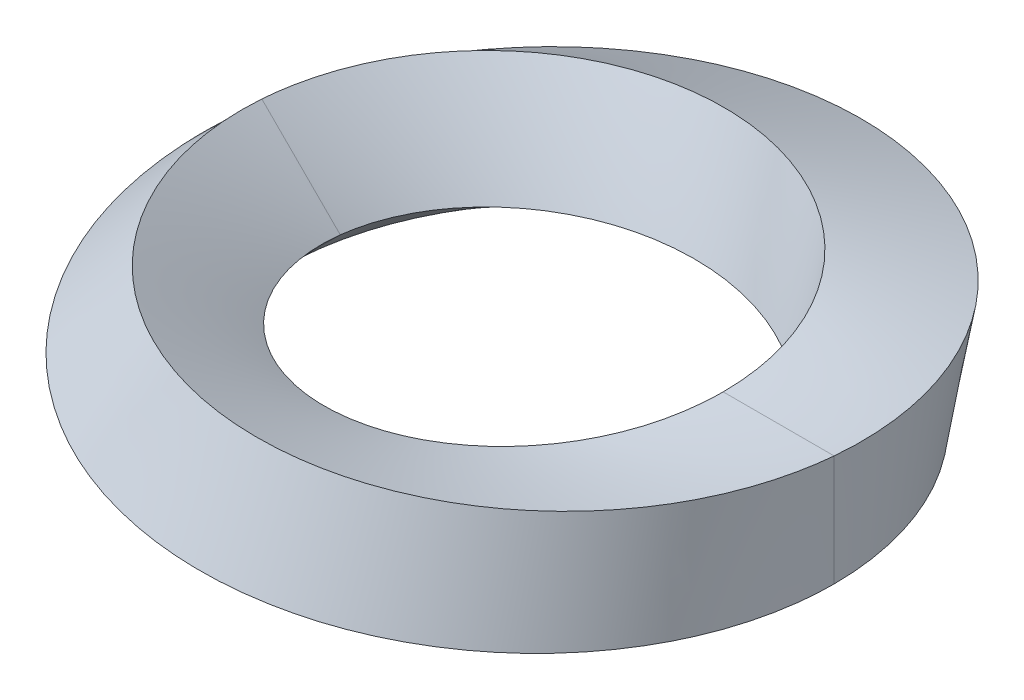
ISO-10303-21;
HEADER;
FILE_DESCRIPTION(('STEP AP214'),'2;1');
FILE_NAME('part.step','',(''),(''),'','','');
FILE_SCHEMA(('AUTOMOTIVE_DESIGN { 1 0 10303 214 1 1 1 1 }'));
ENDSEC;
DATA;
#1=APPLICATION_CONTEXT('core data for automotive mechanical design processes');
#2=APPLICATION_PROTOCOL_DEFINITION('international standard','automotive_design',2000,#1);
#3=PRODUCT_CONTEXT('',#1,'mechanical');
#4=PRODUCT('Part','Part','',(#3));
#5=PRODUCT_RELATED_PRODUCT_CATEGORY('part','',(#4));
#6=PRODUCT_DEFINITION_FORMATION('','',#4);
#7=PRODUCT_DEFINITION_CONTEXT('part definition',#1,'design');
#8=PRODUCT_DEFINITION('design','',#6,#7);
#9=PRODUCT_DEFINITION_SHAPE('','',#8);
#10=(LENGTH_UNIT() NAMED_UNIT(*) SI_UNIT(.MILLI.,.METRE.));
#11=(NAMED_UNIT(*) PLANE_ANGLE_UNIT() SI_UNIT($,.RADIAN.));
#12=(NAMED_UNIT(*) SI_UNIT($,.STERADIAN.) SOLID_ANGLE_UNIT());
#13=UNCERTAINTY_MEASURE_WITH_UNIT(LENGTH_MEASURE(1.E-05),#10,'distance_accuracy_value','');
#14=(GEOMETRIC_REPRESENTATION_CONTEXT(3) GLOBAL_UNCERTAINTY_ASSIGNED_CONTEXT((#13)) GLOBAL_UNIT_ASSIGNED_CONTEXT((#10,
#11,#12)) REPRESENTATION_CONTEXT('',''));
#15=CARTESIAN_POINT('',(0.,0.,0.));
#16=DIRECTION('',(0.,0.,1.));
#17=DIRECTION('',(1.,0.,0.));
#18=AXIS2_PLACEMENT_3D('',#15,#16,#17);
#19=CARTESIAN_POINT('',(67.9377377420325,18.5666751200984,0.));
#20=CARTESIAN_POINT('',(68.5452850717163,19.1742224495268,-8.89396355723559));
#21=CARTESIAN_POINT('',(67.4154024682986,19.7520111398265,-18.0281162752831));
#22=CARTESIAN_POINT('',(61.6450134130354,20.8422366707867,-35.4304583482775));
#23=CARTESIAN_POINT('',(57.0041810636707,21.3547175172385,-43.6909584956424));
#24=CARTESIAN_POINT('',(44.7013487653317,22.3094830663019,-58.01457133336));
#25=CARTESIAN_POINT('',(37.0416808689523,22.7517662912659,-64.0708977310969));
#26=CARTESIAN_POINT('',(19.6925415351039,23.5618769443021,-72.8976314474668));
#27=CARTESIAN_POINT('',(10.0080931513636,23.9297031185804,-75.6623421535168));
#28=CARTESIAN_POINT('',(-10.0080931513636,24.5873570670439,-77.2500592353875));
#29=CARTESIAN_POINT('',(-20.3326172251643,24.8771838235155,-76.0695659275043));
#30=CARTESIAN_POINT('',(-40.0413099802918,25.3760475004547,-69.685987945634));
#31=CARTESIAN_POINT('',(-49.4170484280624,25.5850836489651,-64.4824716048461));
#32=CARTESIAN_POINT('',(-65.674308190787,25.9203527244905,-50.6088850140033));
#33=CARTESIAN_POINT('',(-72.5475136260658,26.0465851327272,-41.9418764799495));
#34=CARTESIAN_POINT('',(-82.5362959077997,26.2150307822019,-22.2959407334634));
#35=CARTESIAN_POINT('',(-85.6448142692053,26.2572437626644,-11.3298225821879));
#36=CARTESIAN_POINT('',(-86.5044128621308,26.2572437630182,0.));
#37=CARTESIAN_POINT('',(67.9377377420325,6.18889170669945,0.));
#38=CARTESIAN_POINT('',(68.1402805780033,6.79652021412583,-8.89515193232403));
#39=CARTESIAN_POINT('',(66.6061712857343,7.39412711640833,-17.8648187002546));
#40=CARTESIAN_POINT('',(60.2124787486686,8.5637586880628,-34.6651861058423));
#41=CARTESIAN_POINT('',(55.3540755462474,9.13574606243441,-42.4878784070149));
#42=CARTESIAN_POINT('',(42.9364315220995,10.2485589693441,-55.802628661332));
#43=CARTESIAN_POINT('',(35.3804729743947,10.7893827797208,-61.2894269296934));
#44=CARTESIAN_POINT('',(18.6037243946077,11.8346600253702,-69.0399545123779));
#45=CARTESIAN_POINT('',(9.38805106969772,12.3391118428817,-71.2997980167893));
#46=CARTESIAN_POINT('',(-9.38805106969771,13.3067868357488,-72.1390580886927));
#47=CARTESIAN_POINT('',(-18.9420655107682,13.7700085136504,-70.7166247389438));
#48=CARTESIAN_POINT('',(-36.9660633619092,14.6507620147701,-64.2575382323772));
#49=CARTESIAN_POINT('',(-45.4291290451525,15.0682924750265,-59.2215315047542));
#50=CARTESIAN_POINT('',(-59.9370655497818,15.8536423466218,-46.1446630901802));
#51=CARTESIAN_POINT('',(-65.9754910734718,16.2214605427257,-38.1070922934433));
#52=CARTESIAN_POINT('',(-74.5990071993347,16.9038434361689,-20.1207714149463));
#53=CARTESIAN_POINT('',(-77.1789728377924,17.2183164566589,-10.1827684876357));
#54=CARTESIAN_POINT('',(-77.7519982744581,17.5048291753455,0.));
#55=CARTESIAN_POINT('',(67.9377377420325,-6.18889170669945,0.));
#56=CARTESIAN_POINT('',(67.7351669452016,-5.58117931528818,-8.89637992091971));
#57=CARTESIAN_POINT('',(65.7969401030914,-4.96375690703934,-17.7015211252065));
#58=CARTESIAN_POINT('',(58.7799440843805,-3.7147192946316,-33.8999138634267));
#59=CARTESIAN_POINT('',(53.7039700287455,-3.08322539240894,-41.2847983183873));
#60=CARTESIAN_POINT('',(41.171514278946,-1.81236512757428,-53.5906859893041));
#61=CARTESIAN_POINT('',(33.7192650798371,-1.17300073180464,-58.5079561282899));
#62=CARTESIAN_POINT('',(17.5149072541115,0.107443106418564,-65.182277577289));
#63=CARTESIAN_POINT('',(8.76800898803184,0.748520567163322,-66.9372538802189));
#64=CARTESIAN_POINT('',(-8.76800898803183,2.02621660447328,-67.0280569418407));
#65=CARTESIAN_POINT('',(-17.5515137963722,2.66283320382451,-65.3636835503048));
#66=CARTESIAN_POINT('',(-33.8908167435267,3.92547652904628,-58.829088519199));
#67=CARTESIAN_POINT('',(-41.4412096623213,4.55150130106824,-53.9605914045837));
#68=CARTESIAN_POINT('',(-54.199822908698,5.78693196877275,-41.6804411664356));
#69=CARTESIAN_POINT('',(-59.4034685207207,6.39633595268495,-34.2723081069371));
#70=CARTESIAN_POINT('',(-66.6617184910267,7.59265609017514,-17.9456020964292));
#71=CARTESIAN_POINT('',(-68.7130968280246,8.17944086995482,-9.03569537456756));
#72=CARTESIAN_POINT('',(-68.9995836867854,8.75241458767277,0.));
#73=CARTESIAN_POINT('',(67.9377377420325,-18.5666751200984,0.));
#74=CARTESIAN_POINT('',(67.3299397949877,-17.9588771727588,-8.89763238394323));
#75=CARTESIAN_POINT('',(64.9877089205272,-17.3216409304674,-17.5382235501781));
#76=CARTESIAN_POINT('',(57.3474094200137,-15.9931972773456,-33.1346416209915));
#77=CARTESIAN_POINT('',(52.0538645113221,-15.3021968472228,-40.0817182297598));
#78=CARTESIAN_POINT('',(39.4065970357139,-13.8732892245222,-51.3787433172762));
#79=CARTESIAN_POINT('',(32.0580571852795,-13.1353842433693,-55.7264853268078));
#80=CARTESIAN_POINT('',(16.4260901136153,-11.6197738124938,-61.3246006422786));
#81=CARTESIAN_POINT('',(8.14796690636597,-10.8420707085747,-62.5747097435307));
#82=CARTESIAN_POINT('',(-8.14796690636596,-9.25435362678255,-61.9170557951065));
#83=CARTESIAN_POINT('',(-16.1609620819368,-8.44434210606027,-60.0107423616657));
#84=CARTESIAN_POINT('',(-30.8155701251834,-6.79980895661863,-53.4006388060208));
#85=CARTESIAN_POINT('',(-37.4532902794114,-5.96528987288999,-48.6996513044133));
#86=CARTESIAN_POINT('',(-48.4625802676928,-4.27977840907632,-37.216219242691));
#87=CARTESIAN_POINT('',(-52.831445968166,-3.4287886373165,-30.4375239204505));
#88=CARTESIAN_POINT('',(-58.7244297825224,-1.71853125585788,-15.7704327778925));
#89=CARTESIAN_POINT('',(-60.2471690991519,-0.859358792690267,-7.88860699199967));
#90=CARTESIAN_POINT('',(-60.2471690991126,0.,0.));
#91=B_SPLINE_SURFACE_WITH_KNOTS('',3,3,((#19,#20,#21,#22,#23,#24,#25,#26,#27,#28,#29,#30,#31,
#32,#33,#34,#35,#36),(#37,#38,#39,#40,#41,#42,#43,#44,#45,#46,#47,#48,#49,#50,#51,#52,#53,#54),
(#55,#56,#57,#58,#59,#60,#61,#62,#63,#64,#65,#66,#67,#68,#69,#70,#71,#72),(#73,#74,#75,#76,#77,
#78,#79,#80,#81,#82,#83,#84,#85,#86,#87,#88,#89,#90)),.UNSPECIFIED.,.F.,.F.,.F.,(4,4),(4,2,2,2,
2,2,2,2,4),(0.,1.),(0.,0.125,0.25,0.375,0.5,0.625,0.75,0.875,1.),.UNSPECIFIED.);
#92=CARTESIAN_POINT('',(67.9377377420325,-18.5666751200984,0.));
#93=CARTESIAN_POINT('',(67.3299397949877,-17.9588771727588,-8.89763238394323));
#94=CARTESIAN_POINT('',(64.9877089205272,-17.3216409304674,-17.5382235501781));
#95=CARTESIAN_POINT('',(57.3474094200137,-15.9931972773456,-33.1346416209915));
#96=CARTESIAN_POINT('',(52.0538645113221,-15.3021968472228,-40.0817182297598));
#97=CARTESIAN_POINT('',(39.4065970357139,-13.8732892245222,-51.3787433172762));
#98=CARTESIAN_POINT('',(32.0580571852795,-13.1353842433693,-55.7264853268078));
#99=CARTESIAN_POINT('',(16.4260901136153,-11.6197738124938,-61.3246006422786));
#100=CARTESIAN_POINT('',(8.14796690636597,-10.8420707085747,-62.5747097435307));
#101=CARTESIAN_POINT('',(-8.14796690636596,-9.25435362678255,-61.9170557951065));
#102=CARTESIAN_POINT('',(-16.1609620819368,-8.44434210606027,-60.0107423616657));
#103=CARTESIAN_POINT('',(-30.8155701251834,-6.79980895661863,-53.4006388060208));
#104=CARTESIAN_POINT('',(-37.4532902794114,-5.96528987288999,-48.6996513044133));
#105=CARTESIAN_POINT('',(-48.4625802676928,-4.27977840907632,-37.216219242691));
#106=CARTESIAN_POINT('',(-52.831445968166,-3.4287886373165,-30.4375239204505));
#107=CARTESIAN_POINT('',(-58.7244297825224,-1.71853125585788,-15.7704327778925));
#108=CARTESIAN_POINT('',(-60.2471690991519,-0.859358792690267,-7.88860699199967));
#109=CARTESIAN_POINT('',(-60.2471690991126,0.,0.));
#110=B_SPLINE_CURVE_WITH_KNOTS('',3,(#92,#93,#94,#95,#96,#97,#98,#99,#100,#101,#102,#103,#104,
#105,#106,#107,#108,#109),.UNSPECIFIED.,.F.,.F.,(4,2,2,2,2,2,2,2,4),(0.,0.125,0.25,0.375,0.5,
0.625,0.75,0.875,1.),.UNSPECIFIED.);
#111=CARTESIAN_POINT('',(67.9377377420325,-18.5666751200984,0.));
#112=VERTEX_POINT('',#111);
#113=CARTESIAN_POINT('',(-60.2471690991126,0.,0.));
#114=VERTEX_POINT('',#113);
#115=EDGE_CURVE('E108',#112,#114,#110,.T.);
#116=DIRECTION('',(0.,-1.,0.));
#117=VECTOR('',#116,1.);
#118=CARTESIAN_POINT('',(67.9377377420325,18.5666751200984,0.));
#119=LINE('',#118,#117);
#120=CARTESIAN_POINT('',(67.9377377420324,18.5666751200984,0.));
#121=VERTEX_POINT('',#120);
#122=EDGE_CURVE('E187',#121,#112,#119,.T.);
#123=CARTESIAN_POINT('',(67.9377377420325,18.5666751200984,0.));
#124=CARTESIAN_POINT('',(68.5452850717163,19.1742224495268,-8.89396355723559));
#125=CARTESIAN_POINT('',(67.4154024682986,19.7520111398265,-18.0281162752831));
#126=CARTESIAN_POINT('',(61.6450134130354,20.8422366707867,-35.4304583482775));
#127=CARTESIAN_POINT('',(57.0041810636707,21.3547175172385,-43.6909584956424));
#128=CARTESIAN_POINT('',(44.7013487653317,22.3094830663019,-58.01457133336));
#129=CARTESIAN_POINT('',(37.0416808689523,22.7517662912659,-64.0708977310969));
#130=CARTESIAN_POINT('',(19.6925415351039,23.5618769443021,-72.8976314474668));
#131=CARTESIAN_POINT('',(10.0080931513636,23.9297031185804,-75.6623421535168));
#132=CARTESIAN_POINT('',(-10.0080931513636,24.5873570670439,-77.2500592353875));
#133=CARTESIAN_POINT('',(-20.3326172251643,24.8771838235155,-76.0695659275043));
#134=CARTESIAN_POINT('',(-40.0413099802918,25.3760475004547,-69.685987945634));
#135=CARTESIAN_POINT('',(-49.4170484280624,25.5850836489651,-64.4824716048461));
#136=CARTESIAN_POINT('',(-65.674308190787,25.9203527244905,-50.6088850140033));
#137=CARTESIAN_POINT('',(-72.5475136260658,26.0465851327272,-41.9418764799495));
#138=CARTESIAN_POINT('',(-82.5362959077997,26.2150307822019,-22.2959407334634));
#139=CARTESIAN_POINT('',(-85.6448142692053,26.2572437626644,-11.3298225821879));
#140=CARTESIAN_POINT('',(-86.5044128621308,26.2572437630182,0.));
#141=B_SPLINE_CURVE_WITH_KNOTS('',3,(#123,#124,#125,#126,#127,#128,#129,#130,#131,#132,#133,
#134,#135,#136,#137,#138,#139,#140),.UNSPECIFIED.,.F.,.F.,(4,2,2,2,2,2,2,2,4),(0.,0.125,0.25,
0.375,0.5,0.625,0.75,0.875,1.),.UNSPECIFIED.);
#142=CARTESIAN_POINT('',(-86.5044128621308,26.2572437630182,0.));
#143=VERTEX_POINT('',#142);
#144=EDGE_CURVE('E81',#121,#143,#141,.T.);
#145=DIRECTION('',(0.707106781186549,-0.707106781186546,0.));
#146=VECTOR('',#145,1.);
#147=CARTESIAN_POINT('',(-86.5044128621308,26.2572437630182,0.));
#148=LINE('',#147,#146);
#149=EDGE_CURVE('E117',#143,#114,#148,.T.);
#150=ORIENTED_EDGE('',*,*,#115,.F.);
#151=ORIENTED_EDGE('',*,*,#122,.F.);
#152=ORIENTED_EDGE('',*,*,#144,.T.);
#153=ORIENTED_EDGE('',*,*,#149,.T.);
#154=EDGE_LOOP('',(#150,#151,#152,#153));
#155=FACE_BOUND('',#154,.T.);
#156=ADVANCED_FACE('F29',(#155),#91,.F.);
#157=CARTESIAN_POINT('',(67.9377377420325,-18.5666751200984,0.));
#158=CARTESIAN_POINT('',(67.3299397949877,-17.9588771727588,-8.89763238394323));
#159=CARTESIAN_POINT('',(64.9877089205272,-17.3216409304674,-17.5382235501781));
#160=CARTESIAN_POINT('',(57.3474094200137,-15.9931972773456,-33.1346416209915));
#161=CARTESIAN_POINT('',(52.0538645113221,-15.3021968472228,-40.0817182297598));
#162=CARTESIAN_POINT('',(39.4065970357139,-13.8732892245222,-51.3787433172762));
#163=CARTESIAN_POINT('',(32.0580571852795,-13.1353842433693,-55.7264853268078));
#164=CARTESIAN_POINT('',(16.4260901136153,-11.6197738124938,-61.3246006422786));
#165=CARTESIAN_POINT('',(8.14796690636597,-10.8420707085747,-62.5747097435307));
#166=CARTESIAN_POINT('',(-8.14796690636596,-9.25435362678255,-61.9170557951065));
#167=CARTESIAN_POINT('',(-16.1609620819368,-8.44434210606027,-60.0107423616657));
#168=CARTESIAN_POINT('',(-30.8155701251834,-6.79980895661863,-53.4006388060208));
#169=CARTESIAN_POINT('',(-37.4532902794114,-5.96528987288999,-48.6996513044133));
#170=CARTESIAN_POINT('',(-48.4625802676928,-4.27977840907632,-37.216219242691));
#171=CARTESIAN_POINT('',(-52.831445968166,-3.4287886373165,-30.4375239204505));
#172=CARTESIAN_POINT('',(-58.7244297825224,-1.71853125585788,-15.7704327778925));
#173=CARTESIAN_POINT('',(-60.2471690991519,-0.859358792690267,-7.88860699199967));
#174=CARTESIAN_POINT('',(-60.2471690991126,0.,0.));
#175=CARTESIAN_POINT('',(80.3155211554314,-18.5666751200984,0.));
#176=CARTESIAN_POINT('',(79.7077309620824,-18.3640783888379,-10.5185849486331));
#177=CARTESIAN_POINT('',(77.0219614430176,-18.1317643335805,-20.7776750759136));
#178=CARTESIAN_POINT('',(68.0741875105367,-17.6095437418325,-39.3231176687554));
#179=CARTESIAN_POINT('',(61.8176563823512,-17.3197037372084,-47.598161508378));
#180=CARTESIAN_POINT('',(46.8112839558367,-16.6853538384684,-61.03077882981));
#181=CARTESIAN_POINT('',(38.0683205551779,-16.3408449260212,-66.1849433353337));
#182=CARTESIAN_POINT('',(19.4814443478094,-15.6004748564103,-72.7524796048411));
#183=CARTESIAN_POINT('',(9.64488090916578,-15.2046148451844,-74.1653010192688));
#184=CARTESIAN_POINT('',(-9.64488090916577,-14.3653547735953,-73.1976260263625));
#185=CARTESIAN_POINT('',(-19.0913337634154,-13.9219560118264,-70.8192625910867));
#186=CARTESIAN_POINT('',(-36.2401194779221,-12.9918884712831,-62.7626822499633));
#187=CARTESIAN_POINT('',(-43.9371795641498,-12.5052211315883,-57.0887507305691));
#188=CARTESIAN_POINT('',(-56.5334245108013,-11.4933031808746,-43.3818533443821));
#189=CARTESIAN_POINT('',(-61.4293784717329,-10.9680541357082,-35.3545664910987));
#190=CARTESIAN_POINT('',(-67.8061442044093,-9.88403109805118,-18.1765397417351));
#191=CARTESIAN_POINT('',(-69.2860155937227,-9.32527840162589,-9.0339622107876));
#192=CARTESIAN_POINT('',(-68.9995836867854,-8.75241458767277,0.));
#193=CARTESIAN_POINT('',(92.6933045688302,-18.5666751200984,0.));
#194=CARTESIAN_POINT('',(92.0855201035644,-18.7692699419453,-12.1395366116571));
#195=CARTESIAN_POINT('',(89.0562139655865,-18.941887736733,-24.0171266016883));
#196=CARTESIAN_POINT('',(78.8009656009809,-19.2258902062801,-45.5115937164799));
#197=CARTESIAN_POINT('',(71.5814482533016,-19.3372106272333,-55.1146047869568));
#198=CARTESIAN_POINT('',(54.2159708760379,-19.4974184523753,-70.6828143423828));
#199=CARTESIAN_POINT('',(44.0785839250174,-19.5463056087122,-76.643401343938));
#200=CARTESIAN_POINT('',(22.5367985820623,-19.5811759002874,-84.1803585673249));
#201=CARTESIAN_POINT('',(11.1417949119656,-19.5671589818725,-85.7558922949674));
#202=CARTESIAN_POINT('',(-11.1417949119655,-19.4763559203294,-84.4781962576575));
#203=CARTESIAN_POINT('',(-22.021705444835,-19.3995699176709,-81.6277828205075));
#204=CARTESIAN_POINT('',(-41.6646688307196,-19.1839679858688,-72.1247256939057));
#205=CARTESIAN_POINT('',(-50.4210688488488,-19.0451523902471,-65.4778501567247));
#206=CARTESIAN_POINT('',(-64.6042687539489,-18.7068279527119,-49.547487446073));
#207=CARTESIAN_POINT('',(-70.0273109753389,-18.5073196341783,-40.2716090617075));
#208=CARTESIAN_POINT('',(-76.8878586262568,-18.0495309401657,-20.5826467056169));
#209=CARTESIAN_POINT('',(-78.3248314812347,-17.7912457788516,-10.1793525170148));
#210=CARTESIAN_POINT('',(-77.751998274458,-17.5048291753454,0.));
#211=CARTESIAN_POINT('',(105.071087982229,-18.5666751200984,0.));
#212=CARTESIAN_POINT('',(104.463307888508,-19.1744552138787,-13.7604884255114));
#213=CARTESIAN_POINT('',(101.090466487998,-19.7520111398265,-27.2565781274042));
#214=CARTESIAN_POINT('',(89.5277436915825,-20.8422366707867,-51.7000697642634));
#215=CARTESIAN_POINT('',(81.3452401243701,-21.3547175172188,-62.6310480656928));
#216=CARTESIAN_POINT('',(61.6206577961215,-22.3094830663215,-80.3348498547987));
#217=CARTESIAN_POINT('',(50.0888472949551,-22.7517662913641,-87.1018593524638));
#218=CARTESIAN_POINT('',(25.5921528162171,-23.5618769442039,-95.6082375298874));
#219=CARTESIAN_POINT('',(12.6387089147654,-23.9297031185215,-97.3464835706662));
#220=CARTESIAN_POINT('',(-12.6387089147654,-24.5873570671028,-95.7587664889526));
#221=CARTESIAN_POINT('',(-24.9520771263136,-24.8771838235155,-92.43630304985));
#222=CARTESIAN_POINT('',(-47.0892181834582,-25.3760475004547,-81.4867691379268));
#223=CARTESIAN_POINT('',(-56.9049581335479,-25.5850836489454,-73.866949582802));
#224=CARTESIAN_POINT('',(-72.6751129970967,-25.9203527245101,-55.7131215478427));
#225=CARTESIAN_POINT('',(-78.6252434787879,-26.0465851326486,-45.1886516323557));
#226=CARTESIAN_POINT('',(-85.9695730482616,-26.2150307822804,-22.9887536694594));
#227=CARTESIAN_POINT('',(-87.3636282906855,-26.2572437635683,-11.3247723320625));
#228=CARTESIAN_POINT('',(-86.5044128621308,-26.2572437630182,0.));
#229=B_SPLINE_SURFACE_WITH_KNOTS('',3,3,((#157,#158,#159,#160,#161,#162,#163,#164,#165,#166,
#167,#168,#169,#170,#171,#172,#173,#174),(#175,#176,#177,#178,#179,#180,#181,#182,#183,#184,
#185,#186,#187,#188,#189,#190,#191,#192),(#193,#194,#195,#196,#197,#198,#199,#200,#201,#202,
#203,#204,#205,#206,#207,#208,#209,#210),(#211,#212,#213,#214,#215,#216,#217,#218,#219,#220,
#221,#222,#223,#224,#225,#226,#227,#228)),.UNSPECIFIED.,.F.,.F.,.F.,(4,4),(4,2,2,2,2,2,2,2,4),
(0.,1.),(0.,0.125,0.25,0.375,0.5,0.625,0.75,0.875,1.),.UNSPECIFIED.);
#230=CARTESIAN_POINT('',(105.071087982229,-18.5666751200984,0.));
#231=CARTESIAN_POINT('',(104.463307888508,-19.1744552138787,-13.7604884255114));
#232=CARTESIAN_POINT('',(101.090466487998,-19.7520111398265,-27.2565781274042));
#233=CARTESIAN_POINT('',(89.5277436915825,-20.8422366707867,-51.7000697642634));
#234=CARTESIAN_POINT('',(81.3452401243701,-21.3547175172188,-62.6310480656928));
#235=CARTESIAN_POINT('',(61.6206577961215,-22.3094830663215,-80.3348498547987));
#236=CARTESIAN_POINT('',(50.0888472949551,-22.7517662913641,-87.1018593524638));
#237=CARTESIAN_POINT('',(25.5921528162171,-23.5618769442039,-95.6082375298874));
#238=CARTESIAN_POINT('',(12.6387089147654,-23.9297031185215,-97.3464835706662));
#239=CARTESIAN_POINT('',(-12.6387089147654,-24.5873570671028,-95.7587664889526));
#240=CARTESIAN_POINT('',(-24.9520771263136,-24.8771838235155,-92.43630304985));
#241=CARTESIAN_POINT('',(-47.0892181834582,-25.3760475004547,-81.4867691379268));
#242=CARTESIAN_POINT('',(-56.9049581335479,-25.5850836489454,-73.866949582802));
#243=CARTESIAN_POINT('',(-72.6751129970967,-25.9203527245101,-55.7131215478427));
#244=CARTESIAN_POINT('',(-78.6252434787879,-26.0465851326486,-45.1886516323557));
#245=CARTESIAN_POINT('',(-85.9695730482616,-26.2150307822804,-22.9887536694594));
#246=CARTESIAN_POINT('',(-87.3636282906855,-26.2572437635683,-11.3247723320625));
#247=CARTESIAN_POINT('',(-86.5044128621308,-26.2572437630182,0.));
#248=B_SPLINE_CURVE_WITH_KNOTS('',3,(#230,#231,#232,#233,#234,#235,#236,#237,#238,#239,#240,
#241,#242,#243,#244,#245,#246,#247),.UNSPECIFIED.,.F.,.F.,(4,2,2,2,2,2,2,2,4),(0.,0.125,0.25,
0.375,0.5,0.625,0.75,0.875,1.),.UNSPECIFIED.);
#249=CARTESIAN_POINT('',(105.071087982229,-18.5666751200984,0.));
#250=VERTEX_POINT('',#249);
#251=CARTESIAN_POINT('',(-86.5044128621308,-26.2572437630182,0.));
#252=VERTEX_POINT('',#251);
#253=EDGE_CURVE('E107',#250,#252,#248,.T.);
#254=DIRECTION('',(1.,0.,0.));
#255=VECTOR('',#254,1.);
#256=CARTESIAN_POINT('',(67.9377377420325,-18.5666751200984,0.));
#257=LINE('',#256,#255);
#258=EDGE_CURVE('E73',#112,#250,#257,.T.);
#259=DIRECTION('',(-0.707106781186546,-0.707106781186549,0.));
#260=VECTOR('',#259,1.);
#261=CARTESIAN_POINT('',(-60.2471690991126,0.,0.));
#262=LINE('',#261,#260);
#263=EDGE_CURVE('E98',#114,#252,#262,.T.);
#264=ORIENTED_EDGE('',*,*,#253,.F.);
#265=ORIENTED_EDGE('',*,*,#258,.F.);
#266=ORIENTED_EDGE('',*,*,#115,.T.);
#267=ORIENTED_EDGE('',*,*,#263,.T.);
#268=EDGE_LOOP('',(#264,#265,#266,#267));
#269=FACE_BOUND('',#268,.T.);
#270=ADVANCED_FACE('F132',(#269),#229,.F.);
#271=CARTESIAN_POINT('',(105.071087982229,-18.5666751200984,0.));
#272=CARTESIAN_POINT('',(104.463307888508,-19.1744552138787,-13.7604884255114));
#273=CARTESIAN_POINT('',(101.090466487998,-19.7520111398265,-27.2565781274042));
#274=CARTESIAN_POINT('',(89.5277436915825,-20.8422366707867,-51.7000697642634));
#275=CARTESIAN_POINT('',(81.3452401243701,-21.3547175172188,-62.6310480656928));
#276=CARTESIAN_POINT('',(61.6206577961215,-22.3094830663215,-80.3348498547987));
#277=CARTESIAN_POINT('',(50.0888472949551,-22.7517662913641,-87.1018593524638));
#278=CARTESIAN_POINT('',(25.5921528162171,-23.5618769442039,-95.6082375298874));
#279=CARTESIAN_POINT('',(12.6387089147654,-23.9297031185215,-97.3464835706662));
#280=CARTESIAN_POINT('',(-12.6387089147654,-24.5873570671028,-95.7587664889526));
#281=CARTESIAN_POINT('',(-24.9520771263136,-24.8771838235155,-92.43630304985));
#282=CARTESIAN_POINT('',(-47.0892181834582,-25.3760475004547,-81.4867691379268));
#283=CARTESIAN_POINT('',(-56.9049581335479,-25.5850836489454,-73.866949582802));
#284=CARTESIAN_POINT('',(-72.6751129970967,-25.9203527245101,-55.7131215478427));
#285=CARTESIAN_POINT('',(-78.6252434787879,-26.0465851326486,-45.1886516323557));
#286=CARTESIAN_POINT('',(-85.9695730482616,-26.2150307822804,-22.9887536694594));
#287=CARTESIAN_POINT('',(-87.3636282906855,-26.2572437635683,-11.3247723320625));
#288=CARTESIAN_POINT('',(-86.5044128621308,-26.2572437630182,0.));
#289=CARTESIAN_POINT('',(105.071087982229,-6.18889170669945,0.));
#290=CARTESIAN_POINT('',(104.868512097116,-6.79661936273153,-13.7593012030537));
#291=CARTESIAN_POINT('',(101.899697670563,-7.39412711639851,-27.4198757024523));
#292=CARTESIAN_POINT('',(90.9602783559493,-8.56375868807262,-52.465342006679));
#293=CARTESIAN_POINT('',(82.995345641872,-9.13574606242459,-63.8341281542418));
#294=CARTESIAN_POINT('',(63.385575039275,-10.248558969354,-82.5467925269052));
#295=CARTESIAN_POINT('',(51.7500551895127,-10.7893827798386,-89.8833301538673));
#296=CARTESIAN_POINT('',(26.6809699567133,-11.8346600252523,-99.4659144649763));
#297=CARTESIAN_POINT('',(13.2587509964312,-12.3391118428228,-101.709027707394));
#298=CARTESIAN_POINT('',(-13.2587509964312,-13.3067868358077,-100.869767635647));
#299=CARTESIAN_POINT('',(-26.3426288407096,-13.7700085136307,-97.7892442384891));
#300=CARTESIAN_POINT('',(-50.1644648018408,-14.6507620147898,-86.915218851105));
#301=CARTESIAN_POINT('',(-60.8928775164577,-15.0682924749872,-79.1278896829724));
#302=CARTESIAN_POINT('',(-78.4123556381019,-15.8536423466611,-60.1773434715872));
#303=CARTESIAN_POINT('',(-85.197266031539,-16.2214605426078,-49.0234358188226));
#304=CARTESIAN_POINT('',(-93.9068617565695,-16.9038434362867,-25.1639229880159));
#305=CARTESIAN_POINT('',(-95.8296929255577,-17.2183964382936,-12.471800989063));
#306=CARTESIAN_POINT('',(-95.2568274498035,-17.5048291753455,0.));
#307=CARTESIAN_POINT('',(105.071087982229,6.18889170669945,0.));
#308=CARTESIAN_POINT('',(105.273646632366,5.58121575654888,-13.7581305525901));
#309=CARTESIAN_POINT('',(102.708928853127,4.9637569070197,-27.5831732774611));
#310=CARTESIAN_POINT('',(92.3928130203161,3.71471929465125,-53.2306142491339));
#311=CARTESIAN_POINT('',(84.6454511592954,3.0832253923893,-65.0372082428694));
#312=CARTESIAN_POINT('',(65.1504922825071,1.81236512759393,-84.7587351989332));
#313=CARTESIAN_POINT('',(53.4112630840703,1.17300073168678,-92.6648009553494));
#314=CARTESIAN_POINT('',(27.7697870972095,-0.107443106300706,-103.323591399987));
#315=CARTESIAN_POINT('',(13.8787930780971,-0.748520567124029,-106.071571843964));
#316=CARTESIAN_POINT('',(-13.8787930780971,-2.02621660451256,-105.980768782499));
#317=CARTESIAN_POINT('',(-27.7331805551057,-2.66283320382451,-103.142185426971));
#318=CARTESIAN_POINT('',(-53.2397114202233,-3.92547652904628,-92.3436685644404));
#319=CARTESIAN_POINT('',(-64.880796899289,-4.55150130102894,-84.3888297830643));
#320=CARTESIAN_POINT('',(-84.1495982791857,-5.78693196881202,-64.6415653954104));
#321=CARTESIAN_POINT('',(-91.7692885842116,-6.39633595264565,-52.8582200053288));
#322=CARTESIAN_POINT('',(-101.844150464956,-7.59265609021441,-27.339092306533));
#323=CARTESIAN_POINT('',(-104.295697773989,-8.17950311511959,-13.6188319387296));
#324=CARTESIAN_POINT('',(-104.009242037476,-8.75241458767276,0.));
#325=CARTESIAN_POINT('',(105.071087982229,18.5666751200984,0.));
#326=CARTESIAN_POINT('',(105.67871322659,17.9590498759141,-13.7569825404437));
#327=CARTESIAN_POINT('',(103.518160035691,17.3216409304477,-27.7464708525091));
#328=CARTESIAN_POINT('',(93.8253476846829,15.9931972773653,-53.9958864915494));
#329=CARTESIAN_POINT('',(86.2955566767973,15.3021968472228,-66.2402883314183));
#330=CARTESIAN_POINT('',(66.9154095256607,13.8732892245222,-86.9706778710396));
#331=CARTESIAN_POINT('',(55.0724709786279,13.1353842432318,-95.4462717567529));
#332=CARTESIAN_POINT('',(28.8586042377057,11.6197738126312,-107.181268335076));
#333=CARTESIAN_POINT('',(14.498835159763,10.8420707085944,-110.434115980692));
#334=CARTESIAN_POINT('',(-14.498835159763,9.25435362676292,-111.091769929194));
#335=CARTESIAN_POINT('',(-29.1237322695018,8.44434210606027,-108.49512661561));
#336=CARTESIAN_POINT('',(-56.3149580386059,6.79980895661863,-97.7721182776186));
#337=CARTESIAN_POINT('',(-68.8687162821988,5.96528987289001,-89.6497698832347));
#338=CARTESIAN_POINT('',(-89.8868409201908,4.27977840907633,-69.105787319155));
#339=CARTESIAN_POINT('',(-98.3413111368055,3.42878863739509,-56.693004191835));
#340=CARTESIAN_POINT('',(-109.781439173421,1.71853125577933,-29.5142616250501));
#341=CARTESIAN_POINT('',(-112.761656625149,0.859425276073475,-14.7658591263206));
#342=CARTESIAN_POINT('',(-112.761656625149,0.,0.));
#343=B_SPLINE_SURFACE_WITH_KNOTS('',3,3,((#271,#272,#273,#274,#275,#276,#277,#278,#279,#280,
#281,#282,#283,#284,#285,#286,#287,#288),(#289,#290,#291,#292,#293,#294,#295,#296,#297,#298,
#299,#300,#301,#302,#303,#304,#305,#306),(#307,#308,#309,#310,#311,#312,#313,#314,#315,#316,
#317,#318,#319,#320,#321,#322,#323,#324),(#325,#326,#327,#328,#329,#330,#331,#332,#333,#334,
#335,#336,#337,#338,#339,#340,#341,#342)),.UNSPECIFIED.,.F.,.F.,.F.,(4,4),(4,2,2,2,2,2,2,2,4),
(0.,1.),(0.,0.125,0.25,0.375,0.5,0.625,0.75,0.875,1.),.UNSPECIFIED.);
#344=CARTESIAN_POINT('',(105.071087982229,18.5666751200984,0.));
#345=CARTESIAN_POINT('',(105.67871322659,17.9590498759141,-13.7569825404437));
#346=CARTESIAN_POINT('',(103.518160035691,17.3216409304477,-27.7464708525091));
#347=CARTESIAN_POINT('',(93.8253476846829,15.9931972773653,-53.9958864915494));
#348=CARTESIAN_POINT('',(86.2955566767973,15.3021968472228,-66.2402883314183));
#349=CARTESIAN_POINT('',(66.9154095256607,13.8732892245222,-86.9706778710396));
#350=CARTESIAN_POINT('',(55.0724709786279,13.1353842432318,-95.4462717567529));
#351=CARTESIAN_POINT('',(28.8586042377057,11.6197738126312,-107.181268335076));
#352=CARTESIAN_POINT('',(14.498835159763,10.8420707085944,-110.434115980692));
#353=CARTESIAN_POINT('',(-14.498835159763,9.25435362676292,-111.091769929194));
#354=CARTESIAN_POINT('',(-29.1237322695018,8.44434210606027,-108.49512661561));
#355=CARTESIAN_POINT('',(-56.3149580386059,6.79980895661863,-97.7721182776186));
#356=CARTESIAN_POINT('',(-68.8687162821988,5.96528987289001,-89.6497698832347));
#357=CARTESIAN_POINT('',(-89.8868409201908,4.27977840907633,-69.105787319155));
#358=CARTESIAN_POINT('',(-98.3413111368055,3.42878863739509,-56.693004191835));
#359=CARTESIAN_POINT('',(-109.781439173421,1.71853125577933,-29.5142616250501));
#360=CARTESIAN_POINT('',(-112.761656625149,0.859425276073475,-14.7658591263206));
#361=CARTESIAN_POINT('',(-112.761656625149,0.,0.));
#362=B_SPLINE_CURVE_WITH_KNOTS('',3,(#344,#345,#346,#347,#348,#349,#350,#351,#352,#353,#354,
#355,#356,#357,#358,#359,#360,#361),.UNSPECIFIED.,.F.,.F.,(4,2,2,2,2,2,2,2,4),(0.,0.125,0.25,
0.375,0.5,0.625,0.75,0.875,1.),.UNSPECIFIED.);
#363=CARTESIAN_POINT('',(105.071087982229,18.5666751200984,0.));
#364=VERTEX_POINT('',#363);
#365=CARTESIAN_POINT('',(-112.761656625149,0.,0.));
#366=VERTEX_POINT('',#365);
#367=EDGE_CURVE('E43',#364,#366,#362,.T.);
#368=DIRECTION('',(0.,1.,0.));
#369=VECTOR('',#368,1.);
#370=CARTESIAN_POINT('',(105.071087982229,18.5666751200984,0.));
#371=LINE('',#370,#369);
#372=EDGE_CURVE('E65',#250,#364,#371,.T.);
#373=DIRECTION('',(-0.707106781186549,0.707106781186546,0.));
#374=VECTOR('',#373,1.);
#375=CARTESIAN_POINT('',(-112.761656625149,0.,0.));
#376=LINE('',#375,#374);
#377=EDGE_CURVE('E91',#252,#366,#376,.T.);
#378=ORIENTED_EDGE('',*,*,#367,.F.);
#379=ORIENTED_EDGE('',*,*,#372,.F.);
#380=ORIENTED_EDGE('',*,*,#253,.T.);
#381=ORIENTED_EDGE('',*,*,#377,.T.);
#382=EDGE_LOOP('',(#378,#379,#380,#381));
#383=FACE_BOUND('',#382,.T.);
#384=ADVANCED_FACE('F152',(#383),#343,.F.);
#385=CARTESIAN_POINT('',(105.071087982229,18.5666751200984,0.));
#386=CARTESIAN_POINT('',(105.67871322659,17.9590498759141,-13.7569825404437));
#387=CARTESIAN_POINT('',(103.518160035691,17.3216409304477,-27.7464708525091));
#388=CARTESIAN_POINT('',(93.8253476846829,15.9931972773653,-53.9958864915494));
#389=CARTESIAN_POINT('',(86.2955566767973,15.3021968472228,-66.2402883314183));
#390=CARTESIAN_POINT('',(66.9154095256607,13.8732892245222,-86.9706778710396));
#391=CARTESIAN_POINT('',(55.0724709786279,13.1353842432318,-95.4462717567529));
#392=CARTESIAN_POINT('',(28.8586042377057,11.6197738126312,-107.181268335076));
#393=CARTESIAN_POINT('',(14.498835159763,10.8420707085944,-110.434115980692));
#394=CARTESIAN_POINT('',(-14.498835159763,9.25435362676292,-111.091769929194));
#395=CARTESIAN_POINT('',(-29.1237322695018,8.44434210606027,-108.49512661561));
#396=CARTESIAN_POINT('',(-56.3149580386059,6.79980895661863,-97.7721182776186));
#397=CARTESIAN_POINT('',(-68.8687162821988,5.96528987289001,-89.6497698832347));
#398=CARTESIAN_POINT('',(-89.8868409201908,4.27977840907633,-69.105787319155));
#399=CARTESIAN_POINT('',(-98.3413111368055,3.42878863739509,-56.693004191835));
#400=CARTESIAN_POINT('',(-109.781439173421,1.71853125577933,-29.5142616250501));
#401=CARTESIAN_POINT('',(-112.761656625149,0.859425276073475,-14.7658591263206));
#402=CARTESIAN_POINT('',(-112.761656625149,0.,0.));
#403=CARTESIAN_POINT('',(92.6933045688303,18.5666751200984,0.));
#404=CARTESIAN_POINT('',(93.3009110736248,18.3641396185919,-12.1359821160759));
#405=CARTESIAN_POINT('',(91.4839075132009,18.1317643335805,-24.5070193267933));
#406=CARTESIAN_POINT('',(83.09856959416,17.6095437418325,-47.8074104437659));
#407=CARTESIAN_POINT('',(76.531764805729,17.3197037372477,-58.7238450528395));
#408=CARTESIAN_POINT('',(59.5107226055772,16.6853538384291,-77.3186423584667));
#409=CARTESIAN_POINT('',(49.0622076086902,16.3408449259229,-84.9878137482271));
#410=CARTESIAN_POINT('',(25.8032500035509,15.6004748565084,-95.7533893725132));
#411=CARTESIAN_POINT('',(13.0019211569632,15.2046148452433,-98.8435247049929));
#412=CARTESIAN_POINT('',(-13.0019211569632,14.3653547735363,-99.8111996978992));
#413=CARTESIAN_POINT('',(-26.1933605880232,13.9219560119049,-97.6866063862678));
#414=CARTESIAN_POINT('',(-50.8904086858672,12.9918884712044,-88.4100748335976));
#415=CARTESIAN_POINT('',(-62.3848269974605,12.5052211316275,-81.260670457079));
#416=CARTESIAN_POINT('',(-81.8159966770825,11.4933031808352,-62.940153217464));
#417=CARTESIAN_POINT('',(-89.743378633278,10.968054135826,-51.7759616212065));
#418=CARTESIAN_POINT('',(-100.699724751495,9.88403109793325,-27.1081546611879));
#419=CARTESIAN_POINT('',(-103.722751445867,9.32539577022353,-13.6204890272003));
#420=CARTESIAN_POINT('',(-104.009242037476,8.75241458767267,0.));
#421=CARTESIAN_POINT('',(80.3155211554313,18.5666751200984,0.));
#422=CARTESIAN_POINT('',(80.9231027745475,18.7692023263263,-10.5149752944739));
#423=CARTESIAN_POINT('',(79.4496549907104,18.9418877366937,-21.2675678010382));
#424=CARTESIAN_POINT('',(72.3717915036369,19.2258902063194,-41.6189343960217));
#425=CARTESIAN_POINT('',(66.7679729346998,19.3372106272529,-51.2074017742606));
#426=CARTESIAN_POINT('',(52.1060356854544,19.4974184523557,-67.6666068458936));
#427=CARTESIAN_POINT('',(43.0519442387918,19.5463056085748,-74.5293557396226));
#428=CARTESIAN_POINT('',(22.7478957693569,19.5811759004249,-84.3255104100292));
#429=CARTESIAN_POINT('',(11.5050071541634,19.5671589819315,-87.2529334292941));
#430=CARTESIAN_POINT('',(-11.5050071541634,19.4763559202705,-88.530629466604));
#431=CARTESIAN_POINT('',(-23.2629889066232,19.3995699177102,-86.8780861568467));
#432=CARTESIAN_POINT('',(-45.46585933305,19.1839679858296,-79.0480313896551));
#433=CARTESIAN_POINT('',(-55.9009377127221,19.0451523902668,-72.8715710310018));
#434=CARTESIAN_POINT('',(-73.745152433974,18.7068279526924,-56.7745191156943));
#435=CARTESIAN_POINT('',(-81.1454461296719,18.507319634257,-46.858919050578));
#436=CARTESIAN_POINT('',(-91.6180103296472,18.0495309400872,-24.7020476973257));
#437=CARTESIAN_POINT('',(-94.6838084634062,17.7913386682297,-12.4751430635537));
#438=CARTESIAN_POINT('',(-95.2568274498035,17.5048291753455,0.));
#439=CARTESIAN_POINT('',(67.9377377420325,18.5666751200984,0.));
#440=CARTESIAN_POINT('',(68.5452850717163,19.1742224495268,-8.89396355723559));
#441=CARTESIAN_POINT('',(67.4154024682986,19.7520111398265,-18.0281162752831));
#442=CARTESIAN_POINT('',(61.6450134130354,20.8422366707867,-35.4304583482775));
#443=CARTESIAN_POINT('',(57.0041810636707,21.3547175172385,-43.6909584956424));
#444=CARTESIAN_POINT('',(44.7013487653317,22.3094830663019,-58.01457133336));
#445=CARTESIAN_POINT('',(37.0416808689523,22.7517662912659,-64.0708977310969));
#446=CARTESIAN_POINT('',(19.6925415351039,23.5618769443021,-72.8976314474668));
#447=CARTESIAN_POINT('',(10.0080931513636,23.9297031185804,-75.6623421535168));
#448=CARTESIAN_POINT('',(-10.0080931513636,24.5873570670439,-77.2500592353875));
#449=CARTESIAN_POINT('',(-20.3326172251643,24.8771838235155,-76.0695659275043));
#450=CARTESIAN_POINT('',(-40.0413099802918,25.3760475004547,-69.685987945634));
#451=CARTESIAN_POINT('',(-49.4170484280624,25.5850836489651,-64.4824716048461));
#452=CARTESIAN_POINT('',(-65.674308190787,25.9203527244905,-50.6088850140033));
#453=CARTESIAN_POINT('',(-72.5475136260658,26.0465851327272,-41.9418764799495));
#454=CARTESIAN_POINT('',(-82.5362959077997,26.2150307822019,-22.2959407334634));
#455=CARTESIAN_POINT('',(-85.6448142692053,26.2572437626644,-11.3298225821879));
#456=CARTESIAN_POINT('',(-86.5044128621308,26.2572437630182,0.));
#457=B_SPLINE_SURFACE_WITH_KNOTS('',3,3,((#385,#386,#387,#388,#389,#390,#391,#392,#393,#394,
#395,#396,#397,#398,#399,#400,#401,#402),(#403,#404,#405,#406,#407,#408,#409,#410,#411,#412,
#413,#414,#415,#416,#417,#418,#419,#420),(#421,#422,#423,#424,#425,#426,#427,#428,#429,#430,
#431,#432,#433,#434,#435,#436,#437,#438),(#439,#440,#441,#442,#443,#444,#445,#446,#447,#448,
#449,#450,#451,#452,#453,#454,#455,#456)),.UNSPECIFIED.,.F.,.F.,.F.,(4,4),(4,2,2,2,2,2,2,2,4),
(0.,1.),(0.,0.125,0.25,0.375,0.5,0.625,0.75,0.875,1.),.UNSPECIFIED.);
#458=DIRECTION('',(0.707106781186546,0.707106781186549,0.));
#459=VECTOR('',#458,1.);
#460=CARTESIAN_POINT('',(-86.5044128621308,26.2572437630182,0.));
#461=LINE('',#460,#459);
#462=EDGE_CURVE('E11',#366,#143,#461,.T.);
#463=DIRECTION('',(-1.,0.,0.));
#464=VECTOR('',#463,1.);
#465=CARTESIAN_POINT('',(67.9377377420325,18.5666751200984,0.));
#466=LINE('',#465,#464);
#467=EDGE_CURVE('E119',#364,#121,#466,.T.);
#468=ORIENTED_EDGE('',*,*,#462,.T.);
#469=ORIENTED_EDGE('',*,*,#144,.F.);
#470=ORIENTED_EDGE('',*,*,#467,.F.);
#471=ORIENTED_EDGE('',*,*,#367,.T.);
#472=EDGE_LOOP('',(#468,#469,#470,#471));
#473=FACE_BOUND('',#472,.T.);
#474=ADVANCED_FACE('F31',(#473),#457,.F.);
#475=CARTESIAN_POINT('',(-86.5044128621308,26.2572437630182,0.));
#476=CARTESIAN_POINT('',(-87.3636282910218,26.2572437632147,11.3247723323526));
#477=CARTESIAN_POINT('',(-85.9695730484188,26.2150307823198,22.9887536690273));
#478=CARTESIAN_POINT('',(-78.6252434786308,26.0465851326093,45.1886516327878));
#479=CARTESIAN_POINT('',(-72.6751129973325,25.9203527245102,55.7131215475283));
#480=CARTESIAN_POINT('',(-56.9049581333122,25.5850836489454,73.8669495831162));
#481=CARTESIAN_POINT('',(-47.0892181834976,25.376047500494,81.4867691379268));
#482=CARTESIAN_POINT('',(-24.9520771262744,24.8771838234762,92.43630304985));
#483=CARTESIAN_POINT('',(-12.6387089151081,24.5873570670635,95.7587664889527));
#484=CARTESIAN_POINT('',(12.6387089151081,23.9297031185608,97.3464835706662));
#485=CARTESIAN_POINT('',(25.5921528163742,23.5618769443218,95.6082375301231));
#486=CARTESIAN_POINT('',(50.0888472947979,22.7517662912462,87.1018593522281));
#487=CARTESIAN_POINT('',(61.6206577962,22.3094830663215,80.3348498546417));
#488=CARTESIAN_POINT('',(81.3452401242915,21.3547175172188,62.63104806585));
#489=CARTESIAN_POINT('',(89.5277436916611,20.8422366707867,51.7000697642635));
#490=CARTESIAN_POINT('',(101.09046648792,19.7520111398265,27.2565781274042));
#491=CARTESIAN_POINT('',(104.463307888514,19.1744552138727,13.7604884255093));
#492=CARTESIAN_POINT('',(105.071087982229,18.5666751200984,0.));
#493=CARTESIAN_POINT('',(-77.7519982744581,17.5048291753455,0.));
#494=CARTESIAN_POINT('',(-78.3248314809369,17.7912457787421,10.179352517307));
#495=CARTESIAN_POINT('',(-76.8878586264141,18.0495309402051,20.5826467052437));
#496=CARTESIAN_POINT('',(-70.0273109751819,18.5073196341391,40.2716090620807));
#497=CARTESIAN_POINT('',(-64.6042687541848,18.706827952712,49.5474874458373));
#498=CARTESIAN_POINT('',(-50.4210688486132,19.0451523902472,65.4778501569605));
#499=CARTESIAN_POINT('',(-41.6646688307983,19.1839679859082,72.1247256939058));
#500=CARTESIAN_POINT('',(-22.0217054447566,19.3995699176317,81.6277828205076));
#501=CARTESIAN_POINT('',(-11.1417949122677,19.4763559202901,84.4781962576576));
#502=CARTESIAN_POINT('',(11.1417949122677,19.5671589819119,85.7558922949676));
#503=CARTESIAN_POINT('',(22.5367985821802,19.5811759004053,84.1803585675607));
#504=CARTESIAN_POINT('',(44.0785839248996,19.5463056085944,76.6434013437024));
#505=CARTESIAN_POINT('',(54.2159708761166,19.497418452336,70.6828143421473));
#506=CARTESIAN_POINT('',(71.5814482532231,19.3372106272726,55.1146047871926));
#507=CARTESIAN_POINT('',(78.8009656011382,19.2258902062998,45.51159371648));
#508=CARTESIAN_POINT('',(89.0562139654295,18.9418877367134,24.0171266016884));
#509=CARTESIAN_POINT('',(92.0855201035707,18.7692699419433,12.1395366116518));
#510=CARTESIAN_POINT('',(92.6933045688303,18.5666751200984,0.));
#511=CARTESIAN_POINT('',(-68.9995836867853,8.75241458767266,0.));
#512=CARTESIAN_POINT('',(-69.2860155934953,9.32527840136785,9.03396221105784));
#513=CARTESIAN_POINT('',(-67.8061442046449,9.8840310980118,18.1765397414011));
#514=CARTESIAN_POINT('',(-61.4293784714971,10.9680541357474,35.3545664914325));
#515=CARTESIAN_POINT('',(-56.5334245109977,11.4933031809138,43.3818533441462));
#516=CARTESIAN_POINT('',(-43.9371795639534,12.5052211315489,57.0887507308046));
#517=CARTESIAN_POINT('',(-36.2401194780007,12.9918884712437,62.7626822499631));
#518=CARTESIAN_POINT('',(-19.0913337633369,13.9219560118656,70.8192625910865));
#519=CARTESIAN_POINT('',(-9.64488090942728,14.3653547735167,73.1976260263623));
#520=CARTESIAN_POINT('',(9.64488090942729,15.2046148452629,74.1653010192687));
#521=CARTESIAN_POINT('',(19.4814443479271,15.6004748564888,72.7524796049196));
#522=CARTESIAN_POINT('',(38.06832055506,16.3408449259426,66.184943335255));
#523=CARTESIAN_POINT('',(46.8112839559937,16.6853538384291,61.0307788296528));
#524=CARTESIAN_POINT('',(61.8176563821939,17.3197037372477,47.5981615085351));
#525=CARTESIAN_POINT('',(68.0741875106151,17.6095437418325,39.3231176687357));
#526=CARTESIAN_POINT('',(77.0219614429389,18.1317643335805,20.7776750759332));
#527=CARTESIAN_POINT('',(79.7077309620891,18.3640783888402,10.5185849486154));
#528=CARTESIAN_POINT('',(80.3155211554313,18.5666751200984,0.));
#529=CARTESIAN_POINT('',(-60.2471690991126,0.,0.));
#530=CARTESIAN_POINT('',(-60.247169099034,0.859358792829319,7.88860699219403));
#531=CARTESIAN_POINT('',(-58.7244297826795,1.7185312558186,15.7704327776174));
#532=CARTESIAN_POINT('',(-52.8314459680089,3.42878863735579,30.4375239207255));
#533=CARTESIAN_POINT('',(-48.46258026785,4.2797784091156,37.2162192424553));
#534=CARTESIAN_POINT('',(-37.4532902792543,5.9652898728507,48.6996513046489));
#535=CARTESIAN_POINT('',(-30.8155701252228,6.79980895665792,53.4006388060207));
#536=CARTESIAN_POINT('',(-16.1609620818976,8.44434210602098,60.0107423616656));
#537=CARTESIAN_POINT('',(-8.1479669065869,9.25435362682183,61.9170557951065));
#538=CARTESIAN_POINT('',(8.14796690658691,10.8420707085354,62.5747097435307));
#539=CARTESIAN_POINT('',(16.4260901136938,11.6197738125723,61.3246006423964));
#540=CARTESIAN_POINT('',(32.0580571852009,13.1353842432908,55.7264853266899));
#541=CARTESIAN_POINT('',(39.4065970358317,13.8732892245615,51.3787433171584));
#542=CARTESIAN_POINT('',(52.0538645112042,15.3021968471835,40.0817182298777));
#543=CARTESIAN_POINT('',(57.3474094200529,15.9931972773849,33.1346416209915));
#544=CARTESIAN_POINT('',(64.9877089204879,17.3216409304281,17.5382235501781));
#545=CARTESIAN_POINT('',(67.3299397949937,17.9588771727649,8.89763238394));
#546=CARTESIAN_POINT('',(67.9377377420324,18.5666751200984,0.));
#547=B_SPLINE_SURFACE_WITH_KNOTS('',3,3,((#475,#476,#477,#478,#479,#480,#481,#482,#483,#484,
#485,#486,#487,#488,#489,#490,#491,#492),(#493,#494,#495,#496,#497,#498,#499,#500,#501,#502,
#503,#504,#505,#506,#507,#508,#509,#510),(#511,#512,#513,#514,#515,#516,#517,#518,#519,#520,
#521,#522,#523,#524,#525,#526,#527,#528),(#529,#530,#531,#532,#533,#534,#535,#536,#537,#538,
#539,#540,#541,#542,#543,#544,#545,#546)),.UNSPECIFIED.,.F.,.F.,.F.,(4,4),(4,2,2,2,2,2,2,2,4),
(0.,1.),(0.,0.125,0.25,0.375,0.5,0.625,0.75,0.875,1.),.UNSPECIFIED.);
#548=CARTESIAN_POINT('',(-60.2471690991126,0.,0.));
#549=CARTESIAN_POINT('',(-60.247169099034,0.859358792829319,7.88860699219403));
#550=CARTESIAN_POINT('',(-58.7244297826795,1.7185312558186,15.7704327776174));
#551=CARTESIAN_POINT('',(-52.8314459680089,3.42878863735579,30.4375239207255));
#552=CARTESIAN_POINT('',(-48.46258026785,4.2797784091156,37.2162192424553));
#553=CARTESIAN_POINT('',(-37.4532902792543,5.9652898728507,48.6996513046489));
#554=CARTESIAN_POINT('',(-30.8155701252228,6.79980895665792,53.4006388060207));
#555=CARTESIAN_POINT('',(-16.1609620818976,8.44434210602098,60.0107423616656));
#556=CARTESIAN_POINT('',(-8.1479669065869,9.25435362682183,61.9170557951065));
#557=CARTESIAN_POINT('',(8.14796690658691,10.8420707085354,62.5747097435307));
#558=CARTESIAN_POINT('',(16.4260901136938,11.6197738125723,61.3246006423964));
#559=CARTESIAN_POINT('',(32.0580571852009,13.1353842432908,55.7264853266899));
#560=CARTESIAN_POINT('',(39.4065970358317,13.8732892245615,51.3787433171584));
#561=CARTESIAN_POINT('',(52.0538645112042,15.3021968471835,40.0817182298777));
#562=CARTESIAN_POINT('',(57.3474094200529,15.9931972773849,33.1346416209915));
#563=CARTESIAN_POINT('',(64.9877089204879,17.3216409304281,17.5382235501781));
#564=CARTESIAN_POINT('',(67.3299397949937,17.9588771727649,8.89763238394));
#565=CARTESIAN_POINT('',(67.9377377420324,18.5666751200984,0.));
#566=B_SPLINE_CURVE_WITH_KNOTS('',3,(#548,#549,#550,#551,#552,#553,#554,#555,#556,#557,#558,
#559,#560,#561,#562,#563,#564,#565),.UNSPECIFIED.,.F.,.F.,(4,2,2,2,2,2,2,2,4),(0.,0.125,0.25,
0.375,0.5,0.625,0.75,0.875,1.),.UNSPECIFIED.);
#567=EDGE_CURVE('E103',#114,#121,#566,.T.);
#568=CARTESIAN_POINT('',(-86.5044128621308,26.2572437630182,0.));
#569=CARTESIAN_POINT('',(-87.3636282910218,26.2572437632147,11.3247723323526));
#570=CARTESIAN_POINT('',(-85.9695730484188,26.2150307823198,22.9887536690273));
#571=CARTESIAN_POINT('',(-78.6252434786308,26.0465851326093,45.1886516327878));
#572=CARTESIAN_POINT('',(-72.6751129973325,25.9203527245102,55.7131215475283));
#573=CARTESIAN_POINT('',(-56.9049581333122,25.5850836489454,73.8669495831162));
#574=CARTESIAN_POINT('',(-47.0892181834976,25.376047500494,81.4867691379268));
#575=CARTESIAN_POINT('',(-24.9520771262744,24.8771838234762,92.43630304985));
#576=CARTESIAN_POINT('',(-12.6387089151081,24.5873570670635,95.7587664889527));
#577=CARTESIAN_POINT('',(12.6387089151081,23.9297031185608,97.3464835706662));
#578=CARTESIAN_POINT('',(25.5921528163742,23.5618769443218,95.6082375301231));
#579=CARTESIAN_POINT('',(50.0888472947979,22.7517662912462,87.1018593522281));
#580=CARTESIAN_POINT('',(61.6206577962,22.3094830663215,80.3348498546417));
#581=CARTESIAN_POINT('',(81.3452401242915,21.3547175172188,62.63104806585));
#582=CARTESIAN_POINT('',(89.5277436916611,20.8422366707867,51.7000697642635));
#583=CARTESIAN_POINT('',(101.09046648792,19.7520111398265,27.2565781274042));
#584=CARTESIAN_POINT('',(104.463307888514,19.1744552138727,13.7604884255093));
#585=CARTESIAN_POINT('',(105.071087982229,18.5666751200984,0.));
#586=B_SPLINE_CURVE_WITH_KNOTS('',3,(#568,#569,#570,#571,#572,#573,#574,#575,#576,#577,#578,
#579,#580,#581,#582,#583,#584,#585),.UNSPECIFIED.,.F.,.F.,(4,2,2,2,2,2,2,2,4),(0.,0.125,0.25,
0.375,0.5,0.625,0.75,0.875,1.),.UNSPECIFIED.);
#587=EDGE_CURVE('E52',#143,#364,#586,.T.);
#588=ORIENTED_EDGE('',*,*,#567,.F.);
#589=ORIENTED_EDGE('',*,*,#149,.F.);
#590=ORIENTED_EDGE('',*,*,#587,.T.);
#591=ORIENTED_EDGE('',*,*,#467,.T.);
#592=EDGE_LOOP('',(#588,#589,#590,#591));
#593=FACE_BOUND('',#592,.T.);
#594=ADVANCED_FACE('F116',(#593),#547,.F.);
#595=CARTESIAN_POINT('',(-60.2471690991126,0.,0.));
#596=CARTESIAN_POINT('',(-60.247169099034,0.859358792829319,7.88860699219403));
#597=CARTESIAN_POINT('',(-58.7244297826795,1.7185312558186,15.7704327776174));
#598=CARTESIAN_POINT('',(-52.8314459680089,3.42878863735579,30.4375239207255));
#599=CARTESIAN_POINT('',(-48.46258026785,4.2797784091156,37.2162192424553));
#600=CARTESIAN_POINT('',(-37.4532902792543,5.9652898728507,48.6996513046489));
#601=CARTESIAN_POINT('',(-30.8155701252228,6.79980895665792,53.4006388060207));
#602=CARTESIAN_POINT('',(-16.1609620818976,8.44434210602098,60.0107423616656));
#603=CARTESIAN_POINT('',(-8.1479669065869,9.25435362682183,61.9170557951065));
#604=CARTESIAN_POINT('',(8.14796690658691,10.8420707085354,62.5747097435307));
#605=CARTESIAN_POINT('',(16.4260901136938,11.6197738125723,61.3246006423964));
#606=CARTESIAN_POINT('',(32.0580571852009,13.1353842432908,55.7264853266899));
#607=CARTESIAN_POINT('',(39.4065970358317,13.8732892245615,51.3787433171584));
#608=CARTESIAN_POINT('',(52.0538645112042,15.3021968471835,40.0817182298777));
#609=CARTESIAN_POINT('',(57.3474094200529,15.9931972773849,33.1346416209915));
#610=CARTESIAN_POINT('',(64.9877089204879,17.3216409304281,17.5382235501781));
#611=CARTESIAN_POINT('',(67.3299397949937,17.9588771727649,8.89763238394));
#612=CARTESIAN_POINT('',(67.9377377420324,18.5666751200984,0.));
#613=CARTESIAN_POINT('',(-68.9995836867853,-8.75241458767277,0.));
#614=CARTESIAN_POINT('',(-68.7130968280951,-8.1794408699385,9.03569537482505));
#615=CARTESIAN_POINT('',(-66.6617184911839,-7.59265609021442,17.9456020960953));
#616=CARTESIAN_POINT('',(-59.4034685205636,-6.39633595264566,34.272308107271));
#617=CARTESIAN_POINT('',(-54.1998229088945,-5.78693196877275,41.6804411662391));
#618=CARTESIAN_POINT('',(-41.4412096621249,-4.55150130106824,53.9605914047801));
#619=CARTESIAN_POINT('',(-33.890816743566,-3.925476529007,58.8290885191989));
#620=CARTESIAN_POINT('',(-17.551513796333,-2.66283320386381,65.3636835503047));
#621=CARTESIAN_POINT('',(-8.76800898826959,-2.02621660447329,67.0280569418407));
#622=CARTESIAN_POINT('',(8.7680089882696,-0.748520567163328,66.9372538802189));
#623=CARTESIAN_POINT('',(17.5149072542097,-0.107443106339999,65.1822775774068));
#624=CARTESIAN_POINT('',(33.7192650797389,1.17300073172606,58.507956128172));
#625=CARTESIAN_POINT('',(41.1715142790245,1.81236512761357,53.5906859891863));
#626=CARTESIAN_POINT('',(53.7039700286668,3.08322539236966,41.2847983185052));
#627=CARTESIAN_POINT('',(58.7799440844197,3.7147192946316,33.8999138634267));
#628=CARTESIAN_POINT('',(65.7969401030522,4.96375690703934,17.7015211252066));
#629=CARTESIAN_POINT('',(67.7351669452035,5.58117931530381,8.89637992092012));
#630=CARTESIAN_POINT('',(67.9377377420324,6.18889170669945,0.));
#631=CARTESIAN_POINT('',(-77.7519982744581,-17.5048291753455,0.));
#632=CARTESIAN_POINT('',(-77.1789728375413,-17.218316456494,10.1827684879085));
#633=CARTESIAN_POINT('',(-74.5990071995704,-16.9038434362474,20.1207714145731));
#634=CARTESIAN_POINT('',(-65.9754910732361,-16.2214605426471,38.1070922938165));
#635=CARTESIAN_POINT('',(-59.9370655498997,-15.8536423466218,46.1446630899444));
#636=CARTESIAN_POINT('',(-45.4291290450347,-15.0682924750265,59.2215315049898));
#637=CARTESIAN_POINT('',(-36.9660633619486,-14.6507620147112,64.2575382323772));
#638=CARTESIAN_POINT('',(-18.942065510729,-13.7700085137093,70.7166247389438));
#639=CARTESIAN_POINT('',(-9.38805106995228,-13.3067868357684,72.1390580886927));
#640=CARTESIAN_POINT('',(9.38805106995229,-12.3391118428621,71.2997980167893));
#641=CARTESIAN_POINT('',(18.6037243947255,-11.8346600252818,69.039954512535));
#642=CARTESIAN_POINT('',(35.3804729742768,-10.7893827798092,61.2894269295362));
#643=CARTESIAN_POINT('',(42.9364315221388,-10.2485589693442,55.8026286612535));
#644=CARTESIAN_POINT('',(55.3540755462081,-9.13574606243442,42.4878784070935));
#645=CARTESIAN_POINT('',(60.2124787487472,-8.5637586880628,34.6651861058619));
#646=CARTESIAN_POINT('',(66.6061712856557,-7.39412711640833,17.864818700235));
#647=CARTESIAN_POINT('',(68.1402805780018,-6.79652021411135,8.89515193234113));
#648=CARTESIAN_POINT('',(67.9377377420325,-6.18889170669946,0.));
#649=CARTESIAN_POINT('',(-86.5044128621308,-26.2572437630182,0.));
#650=CARTESIAN_POINT('',(-85.6448142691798,-26.2572437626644,11.3298225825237));
#651=CARTESIAN_POINT('',(-82.5362959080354,-26.2150307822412,22.2959407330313));
#652=CARTESIAN_POINT('',(-72.5475136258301,-26.0465851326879,41.9418764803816));
#653=CARTESIAN_POINT('',(-65.6743081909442,-25.9203527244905,50.6088850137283));
#654=CARTESIAN_POINT('',(-49.4170484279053,-25.5850836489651,64.482471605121));
#655=CARTESIAN_POINT('',(-40.0413099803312,-25.3760475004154,69.685987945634));
#656=CARTESIAN_POINT('',(-20.3326172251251,-24.8771838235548,76.0695659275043));
#657=CARTESIAN_POINT('',(-10.008093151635,-24.5873570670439,77.2500592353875));
#658=CARTESIAN_POINT('',(10.008093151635,-23.9297031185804,75.6623421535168));
#659=CARTESIAN_POINT('',(19.6925415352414,-23.5618769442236,72.897631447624));
#660=CARTESIAN_POINT('',(37.0416808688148,-22.7517662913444,64.0708977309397));
#661=CARTESIAN_POINT('',(44.7013487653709,-22.3094830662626,58.0145713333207));
#662=CARTESIAN_POINT('',(57.0041810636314,-21.3547175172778,43.6909584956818));
#663=CARTESIAN_POINT('',(61.645013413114,-20.8422366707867,35.4304583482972));
#664=CARTESIAN_POINT('',(67.41540246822,-19.7520111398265,18.0281162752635));
#665=CARTESIAN_POINT('',(68.5452850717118,-19.1742224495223,8.89396355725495));
#666=CARTESIAN_POINT('',(67.9377377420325,-18.5666751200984,0.));
#667=B_SPLINE_SURFACE_WITH_KNOTS('',3,3,((#595,#596,#597,#598,#599,#600,#601,#602,#603,#604,
#605,#606,#607,#608,#609,#610,#611,#612),(#613,#614,#615,#616,#617,#618,#619,#620,#621,#622,
#623,#624,#625,#626,#627,#628,#629,#630),(#631,#632,#633,#634,#635,#636,#637,#638,#639,#640,
#641,#642,#643,#644,#645,#646,#647,#648),(#649,#650,#651,#652,#653,#654,#655,#656,#657,#658,
#659,#660,#661,#662,#663,#664,#665,#666)),.UNSPECIFIED.,.F.,.F.,.F.,(4,4),(4,2,2,2,2,2,2,2,4),
(0.,1.),(0.,0.125,0.25,0.375,0.5,0.625,0.75,0.875,1.),.UNSPECIFIED.);
#668=CARTESIAN_POINT('',(-86.5044128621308,-26.2572437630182,0.));
#669=CARTESIAN_POINT('',(-85.6448142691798,-26.2572437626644,11.3298225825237));
#670=CARTESIAN_POINT('',(-82.5362959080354,-26.2150307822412,22.2959407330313));
#671=CARTESIAN_POINT('',(-72.5475136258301,-26.0465851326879,41.9418764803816));
#672=CARTESIAN_POINT('',(-65.6743081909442,-25.9203527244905,50.6088850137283));
#673=CARTESIAN_POINT('',(-49.4170484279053,-25.5850836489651,64.482471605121));
#674=CARTESIAN_POINT('',(-40.0413099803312,-25.3760475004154,69.685987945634));
#675=CARTESIAN_POINT('',(-20.3326172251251,-24.8771838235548,76.0695659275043));
#676=CARTESIAN_POINT('',(-10.008093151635,-24.5873570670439,77.2500592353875));
#677=CARTESIAN_POINT('',(10.008093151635,-23.9297031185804,75.6623421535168));
#678=CARTESIAN_POINT('',(19.6925415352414,-23.5618769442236,72.897631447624));
#679=CARTESIAN_POINT('',(37.0416808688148,-22.7517662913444,64.0708977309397));
#680=CARTESIAN_POINT('',(44.7013487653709,-22.3094830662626,58.0145713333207));
#681=CARTESIAN_POINT('',(57.0041810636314,-21.3547175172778,43.6909584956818));
#682=CARTESIAN_POINT('',(61.645013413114,-20.8422366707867,35.4304583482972));
#683=CARTESIAN_POINT('',(67.41540246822,-19.7520111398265,18.0281162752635));
#684=CARTESIAN_POINT('',(68.5452850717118,-19.1742224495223,8.89396355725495));
#685=CARTESIAN_POINT('',(67.9377377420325,-18.5666751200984,0.));
#686=B_SPLINE_CURVE_WITH_KNOTS('',3,(#668,#669,#670,#671,#672,#673,#674,#675,#676,#677,#678,
#679,#680,#681,#682,#683,#684,#685),.UNSPECIFIED.,.F.,.F.,(4,2,2,2,2,2,2,2,4),(0.,0.125,0.25,
0.375,0.5,0.625,0.75,0.875,1.),.UNSPECIFIED.);
#687=EDGE_CURVE('E36',#252,#112,#686,.T.);
#688=ORIENTED_EDGE('',*,*,#687,.F.);
#689=ORIENTED_EDGE('',*,*,#263,.F.);
#690=ORIENTED_EDGE('',*,*,#567,.T.);
#691=ORIENTED_EDGE('',*,*,#122,.T.);
#692=EDGE_LOOP('',(#688,#689,#690,#691));
#693=FACE_BOUND('',#692,.T.);
#694=ADVANCED_FACE('F101',(#693),#667,.F.);
#695=CARTESIAN_POINT('',(-86.5044128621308,-26.2572437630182,0.));
#696=CARTESIAN_POINT('',(-85.6448142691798,-26.2572437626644,11.3298225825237));
#697=CARTESIAN_POINT('',(-82.5362959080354,-26.2150307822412,22.2959407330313));
#698=CARTESIAN_POINT('',(-72.5475136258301,-26.0465851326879,41.9418764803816));
#699=CARTESIAN_POINT('',(-65.6743081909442,-25.9203527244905,50.6088850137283));
#700=CARTESIAN_POINT('',(-49.4170484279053,-25.5850836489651,64.482471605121));
#701=CARTESIAN_POINT('',(-40.0413099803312,-25.3760475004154,69.685987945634));
#702=CARTESIAN_POINT('',(-20.3326172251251,-24.8771838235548,76.0695659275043));
#703=CARTESIAN_POINT('',(-10.008093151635,-24.5873570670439,77.2500592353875));
#704=CARTESIAN_POINT('',(10.008093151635,-23.9297031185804,75.6623421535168));
#705=CARTESIAN_POINT('',(19.6925415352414,-23.5618769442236,72.897631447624));
#706=CARTESIAN_POINT('',(37.0416808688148,-22.7517662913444,64.0708977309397));
#707=CARTESIAN_POINT('',(44.7013487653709,-22.3094830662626,58.0145713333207));
#708=CARTESIAN_POINT('',(57.0041810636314,-21.3547175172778,43.6909584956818));
#709=CARTESIAN_POINT('',(61.645013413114,-20.8422366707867,35.4304583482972));
#710=CARTESIAN_POINT('',(67.41540246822,-19.7520111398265,18.0281162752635));
#711=CARTESIAN_POINT('',(68.5452850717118,-19.1742224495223,8.89396355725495));
#712=CARTESIAN_POINT('',(67.9377377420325,-18.5666751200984,0.));
#713=CARTESIAN_POINT('',(-95.2568274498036,-17.5048291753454,0.));
#714=CARTESIAN_POINT('',(-94.6838084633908,-17.7913386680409,12.4751430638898));
#715=CARTESIAN_POINT('',(-91.618010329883,-18.0495309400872,24.7020476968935));
#716=CARTESIAN_POINT('',(-81.1454461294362,-18.5073196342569,46.8589190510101));
#717=CARTESIAN_POINT('',(-73.7451524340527,-18.706827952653,56.77451911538));
#718=CARTESIAN_POINT('',(-55.9009377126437,-19.0451523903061,72.871571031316));
#719=CARTESIAN_POINT('',(-45.4658593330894,-19.1839679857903,79.0480313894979));
#720=CARTESIAN_POINT('',(-23.2629889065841,-19.3995699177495,86.8780861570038));
#721=CARTESIAN_POINT('',(-11.5050071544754,-19.4763559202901,88.5306294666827));
#722=CARTESIAN_POINT('',(11.5050071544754,-19.5671589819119,87.2529334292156));
#723=CARTESIAN_POINT('',(22.7478957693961,-19.5811759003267,84.3255104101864));
#724=CARTESIAN_POINT('',(43.0519442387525,-19.546305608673,74.5293557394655));
#725=CARTESIAN_POINT('',(52.106035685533,-19.4974184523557,67.6666068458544));
#726=CARTESIAN_POINT('',(66.7679729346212,-19.3372106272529,51.2074017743));
#727=CARTESIAN_POINT('',(72.371791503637,-19.2258902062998,41.6189343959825));
#728=CARTESIAN_POINT('',(79.4496549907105,-18.9418877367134,21.2675678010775));
#729=CARTESIAN_POINT('',(80.92310277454,-18.7692023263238,10.5149752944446));
#730=CARTESIAN_POINT('',(80.3155211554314,-18.5666751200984,0.));
#731=CARTESIAN_POINT('',(-104.009242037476,-8.75241458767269,0.));
#732=CARTESIAN_POINT('',(-103.722751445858,-9.32539576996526,13.6204890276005));
#733=CARTESIAN_POINT('',(-100.699724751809,-9.88403109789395,27.1081546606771));
#734=CARTESIAN_POINT('',(-89.7433786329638,-10.9680541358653,51.7759616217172));
#735=CARTESIAN_POINT('',(-81.8159966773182,-11.4933031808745,62.940153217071));
#736=CARTESIAN_POINT('',(-62.3848269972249,-12.5052211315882,81.2606704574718));
#737=CARTESIAN_POINT('',(-50.8904086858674,-12.9918884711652,88.4100748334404));
#738=CARTESIAN_POINT('',(-26.1933605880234,-13.9219560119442,97.6866063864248));
#739=CARTESIAN_POINT('',(-13.0019211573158,-14.3653547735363,99.8111996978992));
#740=CARTESIAN_POINT('',(13.0019211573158,-15.2046148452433,98.8435247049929));
#741=CARTESIAN_POINT('',(25.8032500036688,-15.6004748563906,95.7533893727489));
#742=CARTESIAN_POINT('',(49.0622076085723,-16.3408449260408,84.9878137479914));
#743=CARTESIAN_POINT('',(59.5107226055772,-16.6853538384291,77.3186423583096));
#744=CARTESIAN_POINT('',(76.5317648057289,-17.3197037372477,58.7238450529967));
#745=CARTESIAN_POINT('',(83.0985695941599,-17.6095437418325,47.8074104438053));
#746=CARTESIAN_POINT('',(91.4839075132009,-18.1317643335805,24.5070193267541));
#747=CARTESIAN_POINT('',(93.3009110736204,-18.3641396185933,12.1359821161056));
#748=CARTESIAN_POINT('',(92.6933045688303,-18.5666751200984,0.));
#749=CARTESIAN_POINT('',(-112.761656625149,0.,0.));
#750=CARTESIAN_POINT('',(-112.761656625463,-0.8594252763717,14.7658591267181));
#751=CARTESIAN_POINT('',(-109.781439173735,-1.71853125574,29.5142616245));
#752=CARTESIAN_POINT('',(-98.3413111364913,-3.42878863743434,56.6930041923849));
#753=CARTESIAN_POINT('',(-89.8868409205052,-4.27977840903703,69.105787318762));
#754=CARTESIAN_POINT('',(-68.8687162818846,-5.96528987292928,89.6497698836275));
#755=CARTESIAN_POINT('',(-56.3149580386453,-6.79980895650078,97.7721182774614));
#756=CARTESIAN_POINT('',(-29.1237322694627,-8.44434210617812,108.495126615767));
#757=CARTESIAN_POINT('',(-14.4988351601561,-9.25435362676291,111.091769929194));
#758=CARTESIAN_POINT('',(14.4988351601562,-10.8420707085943,110.434115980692));
#759=CARTESIAN_POINT('',(28.8586042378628,-11.6197738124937,107.181268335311));
#760=CARTESIAN_POINT('',(55.0724709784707,-13.1353842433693,95.4462717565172));
#761=CARTESIAN_POINT('',(66.9154095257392,-13.8732892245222,86.9706778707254));
#762=CARTESIAN_POINT('',(86.2955566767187,-15.3021968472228,66.2402883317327));
#763=CARTESIAN_POINT('',(93.8253476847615,-15.9931972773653,53.9958864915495));
#764=CARTESIAN_POINT('',(103.518160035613,-17.3216409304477,27.7464708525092));
#765=CARTESIAN_POINT('',(105.678713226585,-17.9590498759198,13.7569825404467));
#766=CARTESIAN_POINT('',(105.071087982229,-18.5666751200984,0.));
#767=B_SPLINE_SURFACE_WITH_KNOTS('',3,3,((#695,#696,#697,#698,#699,#700,#701,#702,#703,#704,
#705,#706,#707,#708,#709,#710,#711,#712),(#713,#714,#715,#716,#717,#718,#719,#720,#721,#722,
#723,#724,#725,#726,#727,#728,#729,#730),(#731,#732,#733,#734,#735,#736,#737,#738,#739,#740,
#741,#742,#743,#744,#745,#746,#747,#748),(#749,#750,#751,#752,#753,#754,#755,#756,#757,#758,
#759,#760,#761,#762,#763,#764,#765,#766)),.UNSPECIFIED.,.F.,.F.,.F.,(4,4),(4,2,2,2,2,2,2,2,4),
(0.,1.),(0.,0.125,0.25,0.375,0.5,0.625,0.75,0.875,1.),.UNSPECIFIED.);
#768=CARTESIAN_POINT('',(-112.761656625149,0.,0.));
#769=CARTESIAN_POINT('',(-112.761656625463,-0.8594252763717,14.7658591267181));
#770=CARTESIAN_POINT('',(-109.781439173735,-1.71853125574,29.5142616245));
#771=CARTESIAN_POINT('',(-98.3413111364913,-3.42878863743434,56.6930041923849));
#772=CARTESIAN_POINT('',(-89.8868409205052,-4.27977840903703,69.105787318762));
#773=CARTESIAN_POINT('',(-68.8687162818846,-5.96528987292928,89.6497698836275));
#774=CARTESIAN_POINT('',(-56.3149580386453,-6.79980895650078,97.7721182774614));
#775=CARTESIAN_POINT('',(-29.1237322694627,-8.44434210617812,108.495126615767));
#776=CARTESIAN_POINT('',(-14.4988351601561,-9.25435362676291,111.091769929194));
#777=CARTESIAN_POINT('',(14.4988351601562,-10.8420707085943,110.434115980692));
#778=CARTESIAN_POINT('',(28.8586042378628,-11.6197738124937,107.181268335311));
#779=CARTESIAN_POINT('',(55.0724709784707,-13.1353842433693,95.4462717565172));
#780=CARTESIAN_POINT('',(66.9154095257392,-13.8732892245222,86.9706778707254));
#781=CARTESIAN_POINT('',(86.2955566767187,-15.3021968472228,66.2402883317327));
#782=CARTESIAN_POINT('',(93.8253476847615,-15.9931972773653,53.9958864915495));
#783=CARTESIAN_POINT('',(103.518160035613,-17.3216409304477,27.7464708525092));
#784=CARTESIAN_POINT('',(105.678713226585,-17.9590498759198,13.7569825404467));
#785=CARTESIAN_POINT('',(105.071087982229,-18.5666751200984,0.));
#786=B_SPLINE_CURVE_WITH_KNOTS('',3,(#768,#769,#770,#771,#772,#773,#774,#775,#776,#777,#778,
#779,#780,#781,#782,#783,#784,#785),.UNSPECIFIED.,.F.,.F.,(4,2,2,2,2,2,2,2,4),(0.,0.125,0.25,
0.375,0.5,0.625,0.75,0.875,1.),.UNSPECIFIED.);
#787=EDGE_CURVE('E184',#366,#250,#786,.T.);
#788=ORIENTED_EDGE('',*,*,#787,.F.);
#789=ORIENTED_EDGE('',*,*,#377,.F.);
#790=ORIENTED_EDGE('',*,*,#687,.T.);
#791=ORIENTED_EDGE('',*,*,#258,.T.);
#792=EDGE_LOOP('',(#788,#789,#790,#791));
#793=FACE_BOUND('',#792,.T.);
#794=ADVANCED_FACE('F183',(#793),#767,.F.);
#795=CARTESIAN_POINT('',(-112.761656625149,0.,0.));
#796=CARTESIAN_POINT('',(-112.761656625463,-0.8594252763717,14.7658591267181));
#797=CARTESIAN_POINT('',(-109.781439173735,-1.71853125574,29.5142616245));
#798=CARTESIAN_POINT('',(-98.3413111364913,-3.42878863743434,56.6930041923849));
#799=CARTESIAN_POINT('',(-89.8868409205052,-4.27977840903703,69.105787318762));
#800=CARTESIAN_POINT('',(-68.8687162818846,-5.96528987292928,89.6497698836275));
#801=CARTESIAN_POINT('',(-56.3149580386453,-6.79980895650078,97.7721182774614));
#802=CARTESIAN_POINT('',(-29.1237322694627,-8.44434210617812,108.495126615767));
#803=CARTESIAN_POINT('',(-14.4988351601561,-9.25435362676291,111.091769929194));
#804=CARTESIAN_POINT('',(14.4988351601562,-10.8420707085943,110.434115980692));
#805=CARTESIAN_POINT('',(28.8586042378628,-11.6197738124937,107.181268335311));
#806=CARTESIAN_POINT('',(55.0724709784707,-13.1353842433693,95.4462717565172));
#807=CARTESIAN_POINT('',(66.9154095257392,-13.8732892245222,86.9706778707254));
#808=CARTESIAN_POINT('',(86.2955566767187,-15.3021968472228,66.2402883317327));
#809=CARTESIAN_POINT('',(93.8253476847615,-15.9931972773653,53.9958864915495));
#810=CARTESIAN_POINT('',(103.518160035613,-17.3216409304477,27.7464708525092));
#811=CARTESIAN_POINT('',(105.678713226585,-17.9590498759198,13.7569825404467));
#812=CARTESIAN_POINT('',(105.071087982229,-18.5666751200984,0.));
#813=CARTESIAN_POINT('',(-104.009242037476,8.75241458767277,0.));
#814=CARTESIAN_POINT('',(-104.295697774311,8.17950311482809,13.6188319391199));
#815=CARTESIAN_POINT('',(-101.84415046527,7.59265609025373,27.3390923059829));
#816=CARTESIAN_POINT('',(-91.7692885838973,6.3963359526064,52.8582200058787));
#817=CARTESIAN_POINT('',(-84.1495982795,5.78693196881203,64.6415653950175));
#818=CARTESIAN_POINT('',(-64.8807968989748,4.55150130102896,84.3888297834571));
#819=CARTESIAN_POINT('',(-53.2397114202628,3.92547652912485,92.3436685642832));
#820=CARTESIAN_POINT('',(-27.7331805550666,2.66283320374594,103.142185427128));
#821=CARTESIAN_POINT('',(-13.8787930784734,2.02621660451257,105.980768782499));
#822=CARTESIAN_POINT('',(13.8787930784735,0.748520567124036,106.071571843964));
#823=CARTESIAN_POINT('',(27.7697870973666,0.107443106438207,103.323591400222));
#824=CARTESIAN_POINT('',(53.4112630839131,-1.17300073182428,92.6648009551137));
#825=CARTESIAN_POINT('',(65.1504922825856,-1.81236512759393,84.7587351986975));
#826=CARTESIAN_POINT('',(84.6454511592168,-3.0832253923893,65.0372082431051));
#827=CARTESIAN_POINT('',(92.3928130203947,-3.7147192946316,53.2306142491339));
#828=CARTESIAN_POINT('',(102.708928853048,-4.96375690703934,27.5831732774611));
#829=CARTESIAN_POINT('',(105.273646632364,-5.58121575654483,13.7581305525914));
#830=CARTESIAN_POINT('',(105.071087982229,-6.18889170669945,0.));
#831=CARTESIAN_POINT('',(-95.2568274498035,17.5048291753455,0.));
#832=CARTESIAN_POINT('',(-95.8296929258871,17.218396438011,12.4718009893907));
#833=CARTESIAN_POINT('',(-93.9068617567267,16.903843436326,25.1639229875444));
#834=CARTESIAN_POINT('',(-85.1972660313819,16.2214605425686,49.023435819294));
#835=CARTESIAN_POINT('',(-78.4123556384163,15.8536423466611,60.1773434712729));
#836=CARTESIAN_POINT('',(-60.8928775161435,15.0682924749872,79.1278896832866));
#837=CARTESIAN_POINT('',(-50.1644648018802,14.6507620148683,86.915218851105));
#838=CARTESIAN_POINT('',(-26.3426288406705,13.7700085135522,97.789244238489));
#839=CARTESIAN_POINT('',(-13.2587509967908,13.3067868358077,100.869767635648));
#840=CARTESIAN_POINT('',(13.2587509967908,12.3391118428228,101.709027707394));
#841=CARTESIAN_POINT('',(26.6809699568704,11.8346600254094,99.4659144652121));
#842=CARTESIAN_POINT('',(51.7500551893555,10.7893827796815,89.8833301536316));
#843=CARTESIAN_POINT('',(63.3855750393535,10.248558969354,82.5467925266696));
#844=CARTESIAN_POINT('',(82.9953456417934,9.1357460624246,63.8341281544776));
#845=CARTESIAN_POINT('',(90.9602783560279,8.56375868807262,52.4653420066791));
#846=CARTESIAN_POINT('',(101.899697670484,7.39412711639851,27.4198757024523));
#847=CARTESIAN_POINT('',(104.868512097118,6.79661936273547,13.7593012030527));
#848=CARTESIAN_POINT('',(105.071087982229,6.18889170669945,0.));
#849=CARTESIAN_POINT('',(-86.5044128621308,26.2572437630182,0.));
#850=CARTESIAN_POINT('',(-87.3636282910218,26.2572437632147,11.3247723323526));
#851=CARTESIAN_POINT('',(-85.9695730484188,26.2150307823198,22.9887536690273));
#852=CARTESIAN_POINT('',(-78.6252434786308,26.0465851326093,45.1886516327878));
#853=CARTESIAN_POINT('',(-72.6751129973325,25.9203527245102,55.7131215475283));
#854=CARTESIAN_POINT('',(-56.9049581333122,25.5850836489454,73.8669495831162));
#855=CARTESIAN_POINT('',(-47.0892181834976,25.376047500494,81.4867691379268));
#856=CARTESIAN_POINT('',(-24.9520771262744,24.8771838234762,92.43630304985));
#857=CARTESIAN_POINT('',(-12.6387089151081,24.5873570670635,95.7587664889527));
#858=CARTESIAN_POINT('',(12.6387089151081,23.9297031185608,97.3464835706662));
#859=CARTESIAN_POINT('',(25.5921528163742,23.5618769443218,95.6082375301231));
#860=CARTESIAN_POINT('',(50.0888472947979,22.7517662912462,87.1018593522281));
#861=CARTESIAN_POINT('',(61.6206577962,22.3094830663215,80.3348498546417));
#862=CARTESIAN_POINT('',(81.3452401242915,21.3547175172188,62.63104806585));
#863=CARTESIAN_POINT('',(89.5277436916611,20.8422366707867,51.7000697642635));
#864=CARTESIAN_POINT('',(101.09046648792,19.7520111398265,27.2565781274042));
#865=CARTESIAN_POINT('',(104.463307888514,19.1744552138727,13.7604884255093));
#866=CARTESIAN_POINT('',(105.071087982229,18.5666751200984,0.));
#867=B_SPLINE_SURFACE_WITH_KNOTS('',3,3,((#795,#796,#797,#798,#799,#800,#801,#802,#803,#804,
#805,#806,#807,#808,#809,#810,#811,#812),(#813,#814,#815,#816,#817,#818,#819,#820,#821,#822,
#823,#824,#825,#826,#827,#828,#829,#830),(#831,#832,#833,#834,#835,#836,#837,#838,#839,#840,
#841,#842,#843,#844,#845,#846,#847,#848),(#849,#850,#851,#852,#853,#854,#855,#856,#857,#858,
#859,#860,#861,#862,#863,#864,#865,#866)),.UNSPECIFIED.,.F.,.F.,.F.,(4,4),(4,2,2,2,2,2,2,2,4),
(0.,1.),(0.,0.125,0.25,0.375,0.5,0.625,0.75,0.875,1.),.UNSPECIFIED.);
#868=ORIENTED_EDGE('',*,*,#372,.T.);
#869=ORIENTED_EDGE('',*,*,#587,.F.);
#870=ORIENTED_EDGE('',*,*,#462,.F.);
#871=ORIENTED_EDGE('',*,*,#787,.T.);
#872=EDGE_LOOP('',(#868,#869,#870,#871));
#873=FACE_BOUND('',#872,.T.);
#874=ADVANCED_FACE('F192',(#873),#867,.F.);
#875=CLOSED_SHELL('',(#156,#270,#384,#474,#594,#694,#794,#874));
#876=MANIFOLD_SOLID_BREP('B2',#875);
#877=ADVANCED_BREP_SHAPE_REPRESENTATION('',(#18,#876),#14);
#878=SHAPE_DEFINITION_REPRESENTATION(#9,#877);
ENDSEC;
END-ISO-10303-21;
